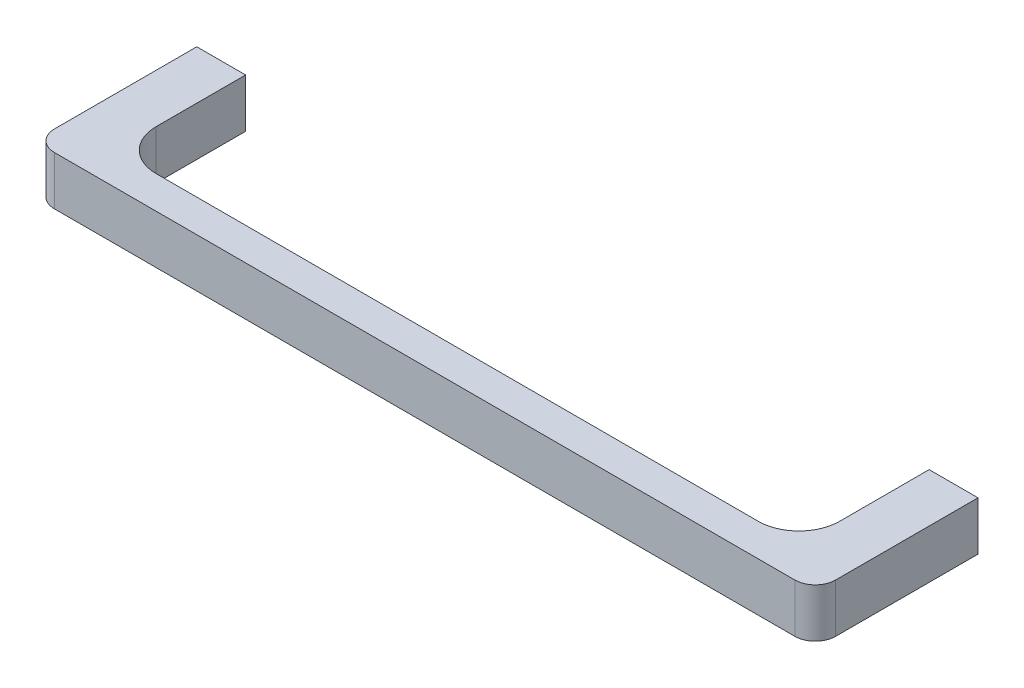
ISO-10303-21;
HEADER;
FILE_DESCRIPTION(('STEP AP214'),'2;1');
FILE_NAME('part.step','',(''),(''),'','','');
FILE_SCHEMA(('AUTOMOTIVE_DESIGN { 1 0 10303 214 1 1 1 1 }'));
ENDSEC;
DATA;
#1=APPLICATION_CONTEXT('core data for automotive mechanical design processes');
#2=APPLICATION_PROTOCOL_DEFINITION('international standard','automotive_design',2000,#1);
#3=PRODUCT_CONTEXT('',#1,'mechanical');
#4=PRODUCT('Part','Part','',(#3));
#5=PRODUCT_RELATED_PRODUCT_CATEGORY('part','',(#4));
#6=PRODUCT_DEFINITION_FORMATION('','',#4);
#7=PRODUCT_DEFINITION_CONTEXT('part definition',#1,'design');
#8=PRODUCT_DEFINITION('design','',#6,#7);
#9=PRODUCT_DEFINITION_SHAPE('','',#8);
#10=(LENGTH_UNIT() NAMED_UNIT(*) SI_UNIT(.MILLI.,.METRE.));
#11=(NAMED_UNIT(*) PLANE_ANGLE_UNIT() SI_UNIT($,.RADIAN.));
#12=(NAMED_UNIT(*) SI_UNIT($,.STERADIAN.) SOLID_ANGLE_UNIT());
#13=UNCERTAINTY_MEASURE_WITH_UNIT(LENGTH_MEASURE(1.E-05),#10,'distance_accuracy_value','');
#14=(GEOMETRIC_REPRESENTATION_CONTEXT(3) GLOBAL_UNCERTAINTY_ASSIGNED_CONTEXT((#13)) GLOBAL_UNIT_ASSIGNED_CONTEXT((#10,
#11,#12)) REPRESENTATION_CONTEXT('',''));
#15=CARTESIAN_POINT('',(0.,0.,0.));
#16=DIRECTION('',(0.,0.,1.));
#17=DIRECTION('',(1.,0.,0.));
#18=AXIS2_PLACEMENT_3D('',#15,#16,#17);
#19=CARTESIAN_POINT('',(-6.0000000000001,-6.,0.));
#20=DIRECTION('',(0.,0.,1.));
#21=DIRECTION('',(0.,-1.,0.));
#22=AXIS2_PLACEMENT_3D('',#19,#20,#21);
#23=PLANE('',#22);
#24=DIRECTION('',(0.,1.,0.));
#25=VECTOR('',#24,1.);
#26=CARTESIAN_POINT('',(5.9999999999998,-6.,0.));
#27=LINE('',#26,#25);
#28=CARTESIAN_POINT('',(5.9999999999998,-6.,0.));
#29=VERTEX_POINT('',#28);
#30=CARTESIAN_POINT('',(5.9999999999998,6.,0.));
#31=VERTEX_POINT('',#30);
#32=EDGE_CURVE('E196',#29,#31,#27,.T.);
#33=ORIENTED_EDGE('',*,*,#32,.F.);
#34=DIRECTION('',(1.,0.,0.));
#35=VECTOR('',#34,1.);
#36=CARTESIAN_POINT('',(-6.0000000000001,-6.,0.));
#37=LINE('',#36,#35);
#38=CARTESIAN_POINT('',(-6.0000000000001,-6.,0.));
#39=VERTEX_POINT('',#38);
#40=EDGE_CURVE('E162',#39,#29,#37,.T.);
#41=ORIENTED_EDGE('',*,*,#40,.F.);
#42=DIRECTION('',(0.,1.,0.));
#43=VECTOR('',#42,1.);
#44=CARTESIAN_POINT('',(-6.0000000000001,-6.,0.));
#45=LINE('',#44,#43);
#46=CARTESIAN_POINT('',(-6.0000000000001,6.,0.));
#47=VERTEX_POINT('',#46);
#48=EDGE_CURVE('E198',#39,#47,#45,.T.);
#49=ORIENTED_EDGE('',*,*,#48,.T.);
#50=DIRECTION('',(1.,0.,0.));
#51=VECTOR('',#50,1.);
#52=CARTESIAN_POINT('',(-6.0000000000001,6.,0.));
#53=LINE('',#52,#51);
#54=EDGE_CURVE('E130',#47,#31,#53,.T.);
#55=ORIENTED_EDGE('',*,*,#54,.T.);
#56=EDGE_LOOP('',(#33,#41,#49,#55));
#57=FACE_BOUND('',#56,.T.);
#58=CARTESIAN_POINT('',(0.,0.,0.));
#59=DIRECTION('',(0.,0.,1.));
#60=DIRECTION('',(0.,-1.,0.));
#61=AXIS2_PLACEMENT_3D('',#58,#59,#60);
#62=CIRCLE('',#61,2.5);
#63=CARTESIAN_POINT('',(0.,-2.5,0.));
#64=VERTEX_POINT('',#63);
#65=EDGE_CURVE('E292',#64,#64,#62,.T.);
#66=ORIENTED_EDGE('',*,*,#65,.T.);
#67=EDGE_LOOP('',(#66));
#68=FACE_BOUND('',#67,.T.);
#69=ADVANCED_FACE('F14',(#57,#68),#23,.F.);
#70=CARTESIAN_POINT('',(181.,-6.,35.));
#71=DIRECTION('',(0.,1.,0.));
#72=DIRECTION('',(-1.,0.,0.));
#73=AXIS2_PLACEMENT_3D('',#70,#71,#72);
#74=CYLINDRICAL_SURFACE('',#73,5.);
#75=DIRECTION('',(0.,1.,0.));
#76=VECTOR('',#75,1.);
#77=CARTESIAN_POINT('',(181.,-6.,40.));
#78=LINE('',#77,#76);
#79=CARTESIAN_POINT('',(181.,-6.,40.));
#80=VERTEX_POINT('',#79);
#81=CARTESIAN_POINT('',(181.,6.,40.));
#82=VERTEX_POINT('',#81);
#83=EDGE_CURVE('E9',#80,#82,#78,.T.);
#84=ORIENTED_EDGE('',*,*,#83,.F.);
#85=CARTESIAN_POINT('',(181.,-6.,35.));
#86=DIRECTION('',(0.,-1.,0.));
#87=DIRECTION('',(1.,0.,0.));
#88=AXIS2_PLACEMENT_3D('',#85,#86,#87);
#89=CIRCLE('',#88,5.);
#90=CARTESIAN_POINT('',(186.,-6.,35.));
#91=VERTEX_POINT('',#90);
#92=EDGE_CURVE('E153',#91,#80,#89,.T.);
#93=ORIENTED_EDGE('',*,*,#92,.F.);
#94=DIRECTION('',(0.,1.,0.));
#95=VECTOR('',#94,1.);
#96=CARTESIAN_POINT('',(186.,-6.,35.));
#97=LINE('',#96,#95);
#98=CARTESIAN_POINT('',(186.,6.,35.));
#99=VERTEX_POINT('',#98);
#100=EDGE_CURVE('E29',#91,#99,#97,.T.);
#101=ORIENTED_EDGE('',*,*,#100,.T.);
#102=CARTESIAN_POINT('',(181.,6.,35.));
#103=DIRECTION('',(0.,-1.,0.));
#104=DIRECTION('',(1.,0.,0.));
#105=AXIS2_PLACEMENT_3D('',#102,#103,#104);
#106=CIRCLE('',#105,5.);
#107=EDGE_CURVE('E113',#99,#82,#106,.T.);
#108=ORIENTED_EDGE('',*,*,#107,.T.);
#109=EDGE_LOOP('',(#84,#93,#101,#108));
#110=FACE_BOUND('',#109,.T.);
#111=ADVANCED_FACE('F114',(#110),#74,.T.);
#112=CARTESIAN_POINT('',(181.,-6.,40.));
#113=DIRECTION('',(0.,0.,-1.));
#114=DIRECTION('',(0.,1.,0.));
#115=AXIS2_PLACEMENT_3D('',#112,#113,#114);
#116=PLANE('',#115);
#117=DIRECTION('',(0.,1.,0.));
#118=VECTOR('',#117,1.);
#119=CARTESIAN_POINT('',(-1.00000000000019,-6.,40.));
#120=LINE('',#119,#118);
#121=CARTESIAN_POINT('',(-1.00000000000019,-6.,40.));
#122=VERTEX_POINT('',#121);
#123=CARTESIAN_POINT('',(-1.00000000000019,6.,40.));
#124=VERTEX_POINT('',#123);
#125=EDGE_CURVE('E22',#122,#124,#120,.T.);
#126=ORIENTED_EDGE('',*,*,#125,.F.);
#127=DIRECTION('',(-1.,0.,0.));
#128=VECTOR('',#127,1.);
#129=CARTESIAN_POINT('',(181.,-6.,40.));
#130=LINE('',#129,#128);
#131=EDGE_CURVE('E109',#80,#122,#130,.T.);
#132=ORIENTED_EDGE('',*,*,#131,.F.);
#133=ORIENTED_EDGE('',*,*,#83,.T.);
#134=DIRECTION('',(-1.,0.,0.));
#135=VECTOR('',#134,1.);
#136=CARTESIAN_POINT('',(181.,6.,40.));
#137=LINE('',#136,#135);
#138=EDGE_CURVE('E106',#82,#124,#137,.T.);
#139=ORIENTED_EDGE('',*,*,#138,.T.);
#140=EDGE_LOOP('',(#126,#132,#133,#139));
#141=FACE_BOUND('',#140,.T.);
#142=ADVANCED_FACE('F16',(#141),#116,.F.);
#143=CARTESIAN_POINT('',(-1.00000000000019,-6.,35.));
#144=DIRECTION('',(0.,1.,0.));
#145=DIRECTION('',(-1.,0.,0.));
#146=AXIS2_PLACEMENT_3D('',#143,#144,#145);
#147=CYLINDRICAL_SURFACE('',#146,5.);
#148=DIRECTION('',(0.,1.,0.));
#149=VECTOR('',#148,1.);
#150=CARTESIAN_POINT('',(-6.0000000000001,-6.,35.));
#151=LINE('',#150,#149);
#152=CARTESIAN_POINT('',(-6.0000000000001,-6.,35.));
#153=VERTEX_POINT('',#152);
#154=CARTESIAN_POINT('',(-6.0000000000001,6.,35.));
#155=VERTEX_POINT('',#154);
#156=EDGE_CURVE('E200',#153,#155,#151,.T.);
#157=ORIENTED_EDGE('',*,*,#156,.F.);
#158=CARTESIAN_POINT('',(-1.00000000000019,-6.,35.));
#159=DIRECTION('',(0.,-1.,0.));
#160=DIRECTION('',(1.,0.,0.));
#161=AXIS2_PLACEMENT_3D('',#158,#159,#160);
#162=CIRCLE('',#161,5.);
#163=EDGE_CURVE('E156',#122,#153,#162,.T.);
#164=ORIENTED_EDGE('',*,*,#163,.F.);
#165=ORIENTED_EDGE('',*,*,#125,.T.);
#166=CARTESIAN_POINT('',(-1.00000000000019,6.,35.));
#167=DIRECTION('',(0.,-1.,0.));
#168=DIRECTION('',(1.,0.,0.));
#169=AXIS2_PLACEMENT_3D('',#166,#167,#168);
#170=CIRCLE('',#169,5.);
#171=EDGE_CURVE('E122',#124,#155,#170,.T.);
#172=ORIENTED_EDGE('',*,*,#171,.T.);
#173=EDGE_LOOP('',(#157,#164,#165,#172));
#174=FACE_BOUND('',#173,.T.);
#175=ADVANCED_FACE('F203',(#174),#147,.T.);
#176=CARTESIAN_POINT('',(-6.0000000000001,-6.,35.));
#177=DIRECTION('',(1.,0.,0.));
#178=DIRECTION('',(0.,1.,0.));
#179=AXIS2_PLACEMENT_3D('',#176,#177,#178);
#180=PLANE('',#179);
#181=ORIENTED_EDGE('',*,*,#48,.F.);
#182=DIRECTION('',(0.,0.,-1.));
#183=VECTOR('',#182,1.);
#184=CARTESIAN_POINT('',(-6.0000000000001,-6.,35.));
#185=LINE('',#184,#183);
#186=EDGE_CURVE('E159',#153,#39,#185,.T.);
#187=ORIENTED_EDGE('',*,*,#186,.F.);
#188=ORIENTED_EDGE('',*,*,#156,.T.);
#189=DIRECTION('',(0.,0.,-1.));
#190=VECTOR('',#189,1.);
#191=CARTESIAN_POINT('',(-6.0000000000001,6.,35.));
#192=LINE('',#191,#190);
#193=EDGE_CURVE('E124',#155,#47,#192,.T.);
#194=ORIENTED_EDGE('',*,*,#193,.T.);
#195=EDGE_LOOP('',(#181,#187,#188,#194));
#196=FACE_BOUND('',#195,.T.);
#197=ADVANCED_FACE('F235',(#196),#180,.F.);
#198=CARTESIAN_POINT('',(5.9999999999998,-6.,0.));
#199=DIRECTION('',(-1.,0.,0.));
#200=DIRECTION('',(0.,-1.,0.));
#201=AXIS2_PLACEMENT_3D('',#198,#199,#200);
#202=PLANE('',#201);
#203=DIRECTION('',(0.,1.,0.));
#204=VECTOR('',#203,1.);
#205=CARTESIAN_POINT('',(5.9999999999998,-6.,22.));
#206=LINE('',#205,#204);
#207=CARTESIAN_POINT('',(5.9999999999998,-6.,22.));
#208=VERTEX_POINT('',#207);
#209=CARTESIAN_POINT('',(5.9999999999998,6.,22.));
#210=VERTEX_POINT('',#209);
#211=EDGE_CURVE('E194',#208,#210,#206,.T.);
#212=ORIENTED_EDGE('',*,*,#211,.F.);
#213=DIRECTION('',(0.,0.,1.));
#214=VECTOR('',#213,1.);
#215=CARTESIAN_POINT('',(5.9999999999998,-6.,0.));
#216=LINE('',#215,#214);
#217=EDGE_CURVE('E165',#29,#208,#216,.T.);
#218=ORIENTED_EDGE('',*,*,#217,.F.);
#219=ORIENTED_EDGE('',*,*,#32,.T.);
#220=DIRECTION('',(0.,0.,1.));
#221=VECTOR('',#220,1.);
#222=CARTESIAN_POINT('',(5.9999999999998,6.,0.));
#223=LINE('',#222,#221);
#224=EDGE_CURVE('E133',#31,#210,#223,.T.);
#225=ORIENTED_EDGE('',*,*,#224,.T.);
#226=EDGE_LOOP('',(#212,#218,#219,#225));
#227=FACE_BOUND('',#226,.T.);
#228=ADVANCED_FACE('F230',(#227),#202,.F.);
#229=CARTESIAN_POINT('',(16.,-6.,22.));
#230=DIRECTION('',(0.,1.,0.));
#231=DIRECTION('',(-1.,0.,0.));
#232=AXIS2_PLACEMENT_3D('',#229,#230,#231);
#233=CYLINDRICAL_SURFACE('',#232,10.);
#234=DIRECTION('',(0.,1.,0.));
#235=VECTOR('',#234,1.);
#236=CARTESIAN_POINT('',(16.,-6.,32.));
#237=LINE('',#236,#235);
#238=CARTESIAN_POINT('',(16.,-6.,32.));
#239=VERTEX_POINT('',#238);
#240=CARTESIAN_POINT('',(16.,6.,32.));
#241=VERTEX_POINT('',#240);
#242=EDGE_CURVE('E192',#239,#241,#237,.T.);
#243=ORIENTED_EDGE('',*,*,#242,.F.);
#244=CARTESIAN_POINT('',(16.,-6.,22.));
#245=DIRECTION('',(0.,-1.,0.));
#246=DIRECTION('',(1.,0.,0.));
#247=AXIS2_PLACEMENT_3D('',#244,#245,#246);
#248=CIRCLE('',#247,10.);
#249=EDGE_CURVE('E168',#239,#208,#248,.T.);
#250=ORIENTED_EDGE('',*,*,#249,.T.);
#251=ORIENTED_EDGE('',*,*,#211,.T.);
#252=CARTESIAN_POINT('',(16.,6.,22.));
#253=DIRECTION('',(0.,-1.,0.));
#254=DIRECTION('',(1.,0.,0.));
#255=AXIS2_PLACEMENT_3D('',#252,#253,#254);
#256=CIRCLE('',#255,10.);
#257=EDGE_CURVE('E136',#241,#210,#256,.T.);
#258=ORIENTED_EDGE('',*,*,#257,.F.);
#259=EDGE_LOOP('',(#243,#250,#251,#258));
#260=FACE_BOUND('',#259,.T.);
#261=ADVANCED_FACE('F226',(#260),#233,.F.);
#262=CARTESIAN_POINT('',(16.,-6.,32.));
#263=DIRECTION('',(0.,0.,1.));
#264=DIRECTION('',(0.,-1.,0.));
#265=AXIS2_PLACEMENT_3D('',#262,#263,#264);
#266=PLANE('',#265);
#267=DIRECTION('',(0.,1.,0.));
#268=VECTOR('',#267,1.);
#269=CARTESIAN_POINT('',(164.,-6.,32.));
#270=LINE('',#269,#268);
#271=CARTESIAN_POINT('',(164.,-6.,32.));
#272=VERTEX_POINT('',#271);
#273=CARTESIAN_POINT('',(164.,6.,32.));
#274=VERTEX_POINT('',#273);
#275=EDGE_CURVE('E190',#272,#274,#270,.T.);
#276=ORIENTED_EDGE('',*,*,#275,.F.);
#277=DIRECTION('',(1.,0.,0.));
#278=VECTOR('',#277,1.);
#279=CARTESIAN_POINT('',(16.,-6.,32.));
#280=LINE('',#279,#278);
#281=EDGE_CURVE('E171',#239,#272,#280,.T.);
#282=ORIENTED_EDGE('',*,*,#281,.F.);
#283=ORIENTED_EDGE('',*,*,#242,.T.);
#284=DIRECTION('',(1.,0.,0.));
#285=VECTOR('',#284,1.);
#286=CARTESIAN_POINT('',(16.,6.,32.));
#287=LINE('',#286,#285);
#288=EDGE_CURVE('E139',#241,#274,#287,.T.);
#289=ORIENTED_EDGE('',*,*,#288,.T.);
#290=EDGE_LOOP('',(#276,#282,#283,#289));
#291=FACE_BOUND('',#290,.T.);
#292=ADVANCED_FACE('F221',(#291),#266,.F.);
#293=CARTESIAN_POINT('',(164.,-6.,22.));
#294=DIRECTION('',(0.,1.,0.));
#295=DIRECTION('',(-1.,0.,0.));
#296=AXIS2_PLACEMENT_3D('',#293,#294,#295);
#297=CYLINDRICAL_SURFACE('',#296,10.);
#298=DIRECTION('',(0.,1.,0.));
#299=VECTOR('',#298,1.);
#300=CARTESIAN_POINT('',(174.,-6.,22.));
#301=LINE('',#300,#299);
#302=CARTESIAN_POINT('',(174.,-6.,22.));
#303=VERTEX_POINT('',#302);
#304=CARTESIAN_POINT('',(174.,6.,22.));
#305=VERTEX_POINT('',#304);
#306=EDGE_CURVE('E188',#303,#305,#301,.T.);
#307=ORIENTED_EDGE('',*,*,#306,.F.);
#308=CARTESIAN_POINT('',(164.,-6.,22.));
#309=DIRECTION('',(0.,-1.,0.));
#310=DIRECTION('',(1.,0.,0.));
#311=AXIS2_PLACEMENT_3D('',#308,#309,#310);
#312=CIRCLE('',#311,10.);
#313=EDGE_CURVE('E174',#303,#272,#312,.T.);
#314=ORIENTED_EDGE('',*,*,#313,.T.);
#315=ORIENTED_EDGE('',*,*,#275,.T.);
#316=CARTESIAN_POINT('',(164.,6.,22.));
#317=DIRECTION('',(0.,-1.,0.));
#318=DIRECTION('',(1.,0.,0.));
#319=AXIS2_PLACEMENT_3D('',#316,#317,#318);
#320=CIRCLE('',#319,10.);
#321=EDGE_CURVE('E142',#305,#274,#320,.T.);
#322=ORIENTED_EDGE('',*,*,#321,.F.);
#323=EDGE_LOOP('',(#307,#314,#315,#322));
#324=FACE_BOUND('',#323,.T.);
#325=ADVANCED_FACE('F218',(#324),#297,.F.);
#326=CARTESIAN_POINT('',(174.,-6.,0.));
#327=DIRECTION('',(-1.,0.,0.));
#328=DIRECTION('',(0.,-1.,0.));
#329=AXIS2_PLACEMENT_3D('',#326,#327,#328);
#330=PLANE('',#329);
#331=DIRECTION('',(0.,1.,0.));
#332=VECTOR('',#331,1.);
#333=CARTESIAN_POINT('',(174.,-6.,0.));
#334=LINE('',#333,#332);
#335=CARTESIAN_POINT('',(174.,-6.,0.));
#336=VERTEX_POINT('',#335);
#337=CARTESIAN_POINT('',(174.,6.,0.));
#338=VERTEX_POINT('',#337);
#339=EDGE_CURVE('E186',#336,#338,#334,.T.);
#340=ORIENTED_EDGE('',*,*,#339,.F.);
#341=DIRECTION('',(0.,0.,1.));
#342=VECTOR('',#341,1.);
#343=CARTESIAN_POINT('',(174.,-6.,0.));
#344=LINE('',#343,#342);
#345=EDGE_CURVE('E177',#336,#303,#344,.T.);
#346=ORIENTED_EDGE('',*,*,#345,.T.);
#347=ORIENTED_EDGE('',*,*,#306,.T.);
#348=DIRECTION('',(0.,0.,1.));
#349=VECTOR('',#348,1.);
#350=CARTESIAN_POINT('',(174.,6.,0.));
#351=LINE('',#350,#349);
#352=EDGE_CURVE('E145',#338,#305,#351,.T.);
#353=ORIENTED_EDGE('',*,*,#352,.F.);
#354=EDGE_LOOP('',(#340,#346,#347,#353));
#355=FACE_BOUND('',#354,.T.);
#356=ADVANCED_FACE('F215',(#355),#330,.T.);
#357=CARTESIAN_POINT('',(186.,-6.,0.));
#358=DIRECTION('',(0.,0.,-1.));
#359=DIRECTION('',(0.,1.,0.));
#360=AXIS2_PLACEMENT_3D('',#357,#358,#359);
#361=PLANE('',#360);
#362=CARTESIAN_POINT('',(180.,0.,0.));
#363=DIRECTION('',(0.,0.,-1.));
#364=DIRECTION('',(0.,1.,0.));
#365=AXIS2_PLACEMENT_3D('',#362,#363,#364);
#366=CIRCLE('',#365,2.5);
#367=CARTESIAN_POINT('',(180.,2.5,0.));
#368=VERTEX_POINT('',#367);
#369=EDGE_CURVE('E291',#368,#368,#366,.T.);
#370=ORIENTED_EDGE('',*,*,#369,.F.);
#371=EDGE_LOOP('',(#370));
#372=FACE_BOUND('',#371,.T.);
#373=DIRECTION('',(0.,1.,0.));
#374=VECTOR('',#373,1.);
#375=CARTESIAN_POINT('',(186.,-6.,0.));
#376=LINE('',#375,#374);
#377=CARTESIAN_POINT('',(186.,-6.,0.));
#378=VERTEX_POINT('',#377);
#379=CARTESIAN_POINT('',(186.,6.,0.));
#380=VERTEX_POINT('',#379);
#381=EDGE_CURVE('E37',#378,#380,#376,.T.);
#382=ORIENTED_EDGE('',*,*,#381,.F.);
#383=DIRECTION('',(-1.,0.,0.));
#384=VECTOR('',#383,1.);
#385=CARTESIAN_POINT('',(186.,-6.,0.));
#386=LINE('',#385,#384);
#387=EDGE_CURVE('E180',#378,#336,#386,.T.);
#388=ORIENTED_EDGE('',*,*,#387,.T.);
#389=ORIENTED_EDGE('',*,*,#339,.T.);
#390=DIRECTION('',(-1.,0.,0.));
#391=VECTOR('',#390,1.);
#392=CARTESIAN_POINT('',(186.,6.,0.));
#393=LINE('',#392,#391);
#394=EDGE_CURVE('E148',#380,#338,#393,.T.);
#395=ORIENTED_EDGE('',*,*,#394,.F.);
#396=EDGE_LOOP('',(#382,#388,#389,#395));
#397=FACE_BOUND('',#396,.T.);
#398=ADVANCED_FACE('F210',(#372,#397),#361,.T.);
#399=CARTESIAN_POINT('',(186.,-6.,35.));
#400=DIRECTION('',(1.,0.,0.));
#401=DIRECTION('',(0.,1.,0.));
#402=AXIS2_PLACEMENT_3D('',#399,#400,#401);
#403=PLANE('',#402);
#404=DIRECTION('',(0.,0.,-1.));
#405=VECTOR('',#404,1.);
#406=CARTESIAN_POINT('',(186.,-6.,35.));
#407=LINE('',#406,#405);
#408=EDGE_CURVE('E182',#91,#378,#407,.T.);
#409=ORIENTED_EDGE('',*,*,#408,.T.);
#410=ORIENTED_EDGE('',*,*,#381,.T.);
#411=DIRECTION('',(0.,0.,-1.));
#412=VECTOR('',#411,1.);
#413=CARTESIAN_POINT('',(186.,6.,35.));
#414=LINE('',#413,#412);
#415=EDGE_CURVE('E151',#99,#380,#414,.T.);
#416=ORIENTED_EDGE('',*,*,#415,.F.);
#417=ORIENTED_EDGE('',*,*,#100,.F.);
#418=EDGE_LOOP('',(#409,#410,#416,#417));
#419=FACE_BOUND('',#418,.T.);
#420=ADVANCED_FACE('F209',(#419),#403,.T.);
#421=CARTESIAN_POINT('',(181.,-6.,35.));
#422=DIRECTION('',(0.,-1.,0.));
#423=DIRECTION('',(1.,0.,0.));
#424=AXIS2_PLACEMENT_3D('',#421,#422,#423);
#425=PLANE('',#424);
#426=ORIENTED_EDGE('',*,*,#92,.T.);
#427=ORIENTED_EDGE('',*,*,#131,.T.);
#428=ORIENTED_EDGE('',*,*,#163,.T.);
#429=ORIENTED_EDGE('',*,*,#186,.T.);
#430=ORIENTED_EDGE('',*,*,#40,.T.);
#431=ORIENTED_EDGE('',*,*,#217,.T.);
#432=ORIENTED_EDGE('',*,*,#249,.F.);
#433=ORIENTED_EDGE('',*,*,#281,.T.);
#434=ORIENTED_EDGE('',*,*,#313,.F.);
#435=ORIENTED_EDGE('',*,*,#345,.F.);
#436=ORIENTED_EDGE('',*,*,#387,.F.);
#437=ORIENTED_EDGE('',*,*,#408,.F.);
#438=EDGE_LOOP('',(#426,#427,#428,#429,#430,#431,#432,#433,#434,#435,#436,#437));
#439=FACE_BOUND('',#438,.T.);
#440=ADVANCED_FACE('F205',(#439),#425,.T.);
#441=CARTESIAN_POINT('',(181.,6.,35.));
#442=DIRECTION('',(0.,-1.,0.));
#443=DIRECTION('',(1.,0.,0.));
#444=AXIS2_PLACEMENT_3D('',#441,#442,#443);
#445=PLANE('',#444);
#446=ORIENTED_EDGE('',*,*,#107,.F.);
#447=ORIENTED_EDGE('',*,*,#415,.T.);
#448=ORIENTED_EDGE('',*,*,#394,.T.);
#449=ORIENTED_EDGE('',*,*,#352,.T.);
#450=ORIENTED_EDGE('',*,*,#321,.T.);
#451=ORIENTED_EDGE('',*,*,#288,.F.);
#452=ORIENTED_EDGE('',*,*,#257,.T.);
#453=ORIENTED_EDGE('',*,*,#224,.F.);
#454=ORIENTED_EDGE('',*,*,#54,.F.);
#455=ORIENTED_EDGE('',*,*,#193,.F.);
#456=ORIENTED_EDGE('',*,*,#171,.F.);
#457=ORIENTED_EDGE('',*,*,#138,.F.);
#458=EDGE_LOOP('',(#446,#447,#448,#449,#450,#451,#452,#453,#454,#455,#456,#457));
#459=FACE_BOUND('',#458,.T.);
#460=ADVANCED_FACE('F119',(#459),#445,.F.);
#461=CARTESIAN_POINT('',(180.,0.,10.));
#462=DIRECTION('',(0.,0.,-1.));
#463=DIRECTION('',(0.,1.,0.));
#464=AXIS2_PLACEMENT_3D('',#461,#462,#463);
#465=CYLINDRICAL_SURFACE('',#464,2.5);
#466=CARTESIAN_POINT('',(180.,0.,10.));
#467=DIRECTION('',(0.,0.,-1.));
#468=DIRECTION('',(0.,1.,0.));
#469=AXIS2_PLACEMENT_3D('',#466,#467,#468);
#470=CIRCLE('',#469,2.5);
#471=CARTESIAN_POINT('',(180.,2.5,10.));
#472=VERTEX_POINT('',#471);
#473=EDGE_CURVE('E117',#472,#472,#470,.T.);
#474=ORIENTED_EDGE('',*,*,#473,.F.);
#475=EDGE_LOOP('',(#474));
#476=FACE_BOUND('',#475,.T.);
#477=ORIENTED_EDGE('',*,*,#369,.T.);
#478=EDGE_LOOP('',(#477));
#479=FACE_BOUND('',#478,.T.);
#480=ADVANCED_FACE('F270',(#476,#479),#465,.F.);
#481=CARTESIAN_POINT('',(180.,0.,10.));
#482=DIRECTION('',(0.,0.,-1.));
#483=DIRECTION('',(0.,1.,0.));
#484=AXIS2_PLACEMENT_3D('',#481,#482,#483);
#485=PLANE('',#484);
#486=ORIENTED_EDGE('',*,*,#473,.T.);
#487=EDGE_LOOP('',(#486));
#488=FACE_BOUND('',#487,.T.);
#489=ADVANCED_FACE('F271',(#488),#485,.T.);
#490=CARTESIAN_POINT('',(0.,0.,10.));
#491=DIRECTION('',(0.,0.,-1.));
#492=DIRECTION('',(0.,1.,0.));
#493=AXIS2_PLACEMENT_3D('',#490,#491,#492);
#494=CYLINDRICAL_SURFACE('',#493,2.5);
#495=CARTESIAN_POINT('',(0.,0.,10.));
#496=DIRECTION('',(0.,0.,1.));
#497=DIRECTION('',(0.,-1.,0.));
#498=AXIS2_PLACEMENT_3D('',#495,#496,#497);
#499=CIRCLE('',#498,2.5);
#500=CARTESIAN_POINT('',(0.,-2.5,10.));
#501=VERTEX_POINT('',#500);
#502=EDGE_CURVE('E290',#501,#501,#499,.T.);
#503=ORIENTED_EDGE('',*,*,#502,.T.);
#504=EDGE_LOOP('',(#503));
#505=FACE_BOUND('',#504,.T.);
#506=ORIENTED_EDGE('',*,*,#65,.F.);
#507=EDGE_LOOP('',(#506));
#508=FACE_BOUND('',#507,.T.);
#509=ADVANCED_FACE('F278',(#505,#508),#494,.F.);
#510=CARTESIAN_POINT('',(0.,0.,10.));
#511=DIRECTION('',(0.,0.,1.));
#512=DIRECTION('',(0.,-1.,0.));
#513=AXIS2_PLACEMENT_3D('',#510,#511,#512);
#514=PLANE('',#513);
#515=ORIENTED_EDGE('',*,*,#502,.F.);
#516=EDGE_LOOP('',(#515));
#517=FACE_BOUND('',#516,.T.);
#518=ADVANCED_FACE('F275',(#517),#514,.F.);
#519=CLOSED_SHELL('',(#69,#111,#142,#175,#197,#228,#261,#292,#325,#356,#398,#420,#440,#460,#480,
#489,#509,#518));
#520=MANIFOLD_SOLID_BREP('B1',#519);
#521=ADVANCED_BREP_SHAPE_REPRESENTATION('',(#18,#520),#14);
#522=SHAPE_DEFINITION_REPRESENTATION(#9,#521);
ENDSEC;
END-ISO-10303-21;
